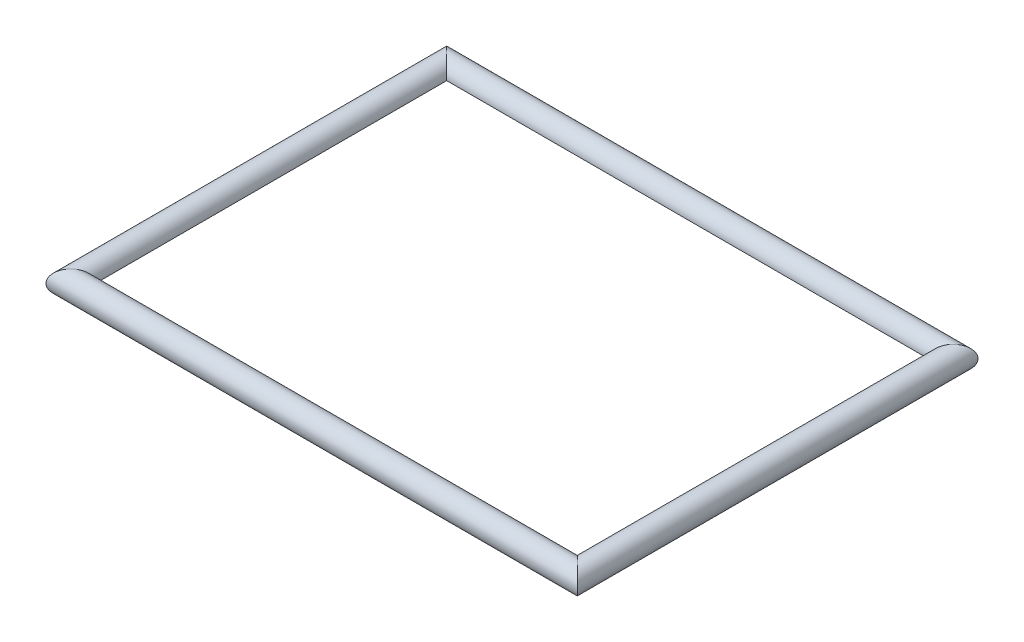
from build123d import *

# Parameters (mm, degrees)
SWEEP1_PROFILE_R   = 5
CUT_EXTRUDE1_REACH = 135.864
SKETCH7_W          = 203.6
SKETCH7_H          = 151.1


with BuildPart() as part:
    # Sweep1: sweep along a path in Sketch1
    with BuildLine(Plane(origin=(0, 0, 0), x_dir=(1, 0, 0), z_dir=(0, 1, 0))) as sweep1_path:
        Line((-101.8, 75.55), (101.8, 75.55))
        Line((101.8, 75.55), (101.8, -75.55))
        Line((101.8, -75.55), (-101.8, -75.55))
        Line((-101.8, -75.55), (-101.8, 75.55))
    # Sweep1 profile (on start of the path) → Sweep1 (sweep)
    with BuildSketch(Plane(origin=(-101.8, 0, -75.55), x_dir=(0, 0, 1), z_dir=(1, 0, 0))):
        Circle(SWEEP1_PROFILE_R)
    sweep(path=sweep1_path.line, transition=Transition.RIGHT)

    # Sketch7 → Cut-Extrude1 (cut, up to next)
    with BuildSketch(Plane(origin=(0, 0, 0), x_dir=(1, 0, 0), z_dir=(0, 1, 0)), mode=Mode.PRIVATE) as cut_extrude1_sk1:
        Rectangle(SKETCH7_W, SKETCH7_H)
    cut_extrude1_tool1 = extrude(cut_extrude1_sk1.sketch, amount=-CUT_EXTRUDE1_REACH, mode=Mode.PRIVATE) & part.part
    add(cut_extrude1_tool1.solids().sort_by_distance((0, 0, 0))[0], mode=Mode.SUBTRACT)


solid = part.part
